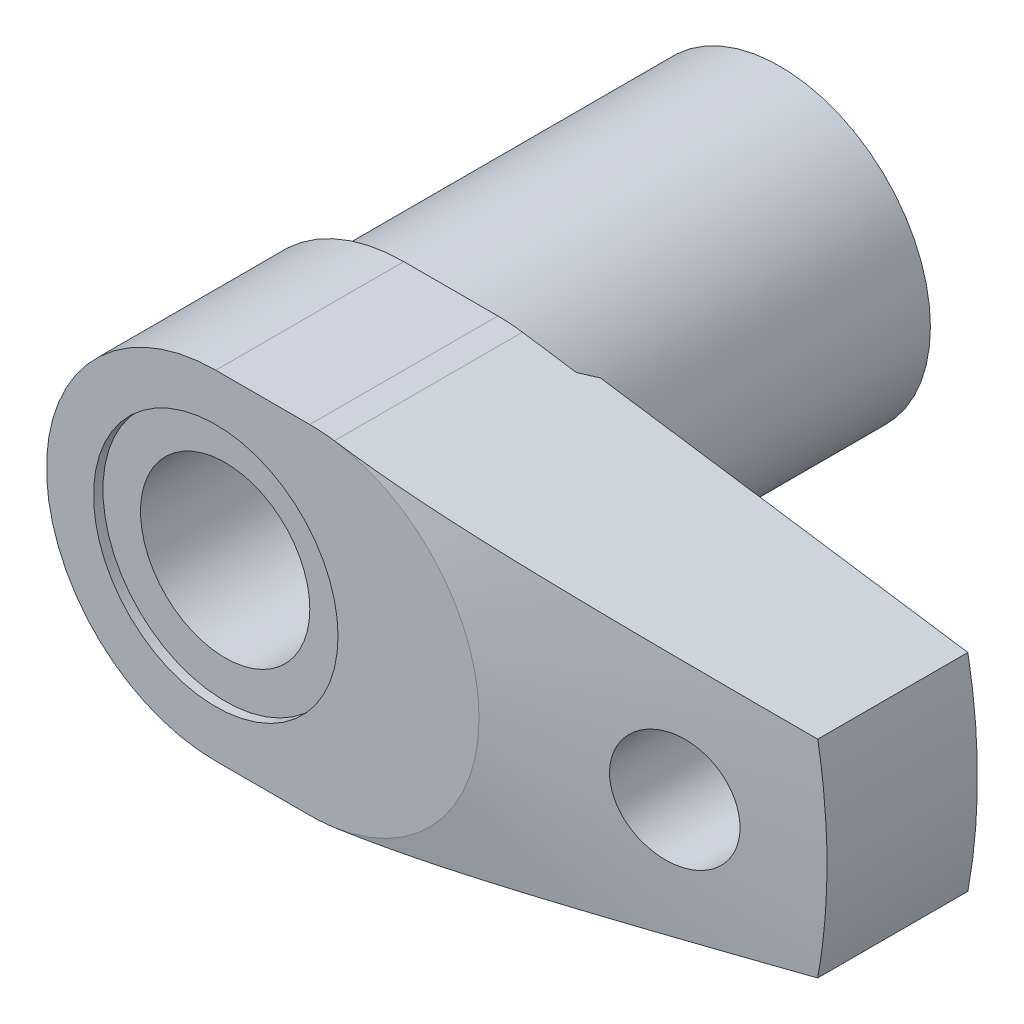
ISO-10303-21;
HEADER;
FILE_DESCRIPTION(('STEP AP214'),'2;1');
FILE_NAME('part.step','',(''),(''),'','','');
FILE_SCHEMA(('AUTOMOTIVE_DESIGN { 1 0 10303 214 1 1 1 1 }'));
ENDSEC;
DATA;
#1=APPLICATION_CONTEXT('core data for automotive mechanical design processes');
#2=APPLICATION_PROTOCOL_DEFINITION('international standard','automotive_design',2000,#1);
#3=PRODUCT_CONTEXT('',#1,'mechanical');
#4=PRODUCT('Part','Part','',(#3));
#5=PRODUCT_RELATED_PRODUCT_CATEGORY('part','',(#4));
#6=PRODUCT_DEFINITION_FORMATION('','',#4);
#7=PRODUCT_DEFINITION_CONTEXT('part definition',#1,'design');
#8=PRODUCT_DEFINITION('design','',#6,#7);
#9=PRODUCT_DEFINITION_SHAPE('','',#8);
#10=(LENGTH_UNIT() NAMED_UNIT(*) SI_UNIT(.MILLI.,.METRE.));
#11=(NAMED_UNIT(*) PLANE_ANGLE_UNIT() SI_UNIT($,.RADIAN.));
#12=(NAMED_UNIT(*) SI_UNIT($,.STERADIAN.) SOLID_ANGLE_UNIT());
#13=UNCERTAINTY_MEASURE_WITH_UNIT(LENGTH_MEASURE(1.E-05),#10,'distance_accuracy_value','');
#14=(GEOMETRIC_REPRESENTATION_CONTEXT(3) GLOBAL_UNCERTAINTY_ASSIGNED_CONTEXT((#13)) GLOBAL_UNIT_ASSIGNED_CONTEXT((#10,
#11,#12)) REPRESENTATION_CONTEXT('',''));
#15=CARTESIAN_POINT('',(0.,0.,0.));
#16=DIRECTION('',(0.,0.,1.));
#17=DIRECTION('',(1.,0.,0.));
#18=AXIS2_PLACEMENT_3D('',#15,#16,#17);
#19=CARTESIAN_POINT('',(-16.,0.,40.));
#20=DIRECTION('',(0.,0.,-1.));
#21=DIRECTION('',(-1.,0.,0.));
#22=AXIS2_PLACEMENT_3D('',#19,#20,#21);
#23=PLANE('',#22);
#24=CARTESIAN_POINT('',(0.,0.,40.));
#25=DIRECTION('',(0.,0.,1.));
#26=DIRECTION('',(1.,0.,0.));
#27=AXIS2_PLACEMENT_3D('',#24,#25,#26);
#28=CIRCLE('',#27,16.);
#29=CARTESIAN_POINT('',(16.,0.,40.));
#30=VERTEX_POINT('',#29);
#31=EDGE_CURVE('E216',#30,#30,#28,.T.);
#32=ORIENTED_EDGE('',*,*,#31,.T.);
#33=EDGE_LOOP('',(#32));
#34=FACE_BOUND('',#33,.T.);
#35=DIRECTION('',(0.989389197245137,-0.145289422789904,0.));
#36=VECTOR('',#35,1.);
#37=CARTESIAN_POINT('',(12.6152096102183,17.8090055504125,40.));
#38=LINE('',#37,#36);
#39=CARTESIAN_POINT('',(12.6152096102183,17.8090055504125,40.));
#40=VERTEX_POINT('',#39);
#41=CARTESIAN_POINT('',(18.362700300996,16.9650003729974,40.));
#42=VERTEX_POINT('',#41);
#43=EDGE_CURVE('E238',#40,#42,#38,.T.);
#44=ORIENTED_EDGE('',*,*,#43,.T.);
#45=CARTESIAN_POINT('',(0.,0.,40.));
#46=DIRECTION('',(0.,0.,1.));
#47=DIRECTION('',(-1.,0.,0.));
#48=AXIS2_PLACEMENT_3D('',#45,#46,#47);
#49=CIRCLE('',#48,25.);
#50=CARTESIAN_POINT('',(18.362700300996,-16.9650003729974,40.));
#51=VERTEX_POINT('',#50);
#52=EDGE_CURVE('E181',#51,#42,#49,.T.);
#53=ORIENTED_EDGE('',*,*,#52,.F.);
#54=DIRECTION('',(-0.989389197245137,-0.145289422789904,0.));
#55=VECTOR('',#54,1.);
#56=CARTESIAN_POINT('',(31.613698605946,-15.0191231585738,40.));
#57=LINE('',#56,#55);
#58=CARTESIAN_POINT('',(12.6152096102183,-17.8090055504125,40.));
#59=VERTEX_POINT('',#58);
#60=EDGE_CURVE('E236',#51,#59,#57,.T.);
#61=ORIENTED_EDGE('',*,*,#60,.T.);
#62=CARTESIAN_POINT('',(10.,0.,40.));
#63=DIRECTION('',(0.,0.,-1.));
#64=DIRECTION('',(-1.,0.,0.));
#65=AXIS2_PLACEMENT_3D('',#62,#63,#64);
#66=CIRCLE('',#65,18.);
#67=CARTESIAN_POINT('',(10.,-18.,40.));
#68=VERTEX_POINT('',#67);
#69=EDGE_CURVE('E233',#59,#68,#66,.T.);
#70=ORIENTED_EDGE('',*,*,#69,.T.);
#71=DIRECTION('',(-1.,0.,0.));
#72=VECTOR('',#71,1.);
#73=CARTESIAN_POINT('',(10.,-18.,40.));
#74=LINE('',#73,#72);
#75=CARTESIAN_POINT('',(0.,-18.,40.));
#76=VERTEX_POINT('',#75);
#77=EDGE_CURVE('E73',#68,#76,#74,.T.);
#78=ORIENTED_EDGE('',*,*,#77,.T.);
#79=CARTESIAN_POINT('',(0.,0.,40.));
#80=DIRECTION('',(0.,0.,1.));
#81=DIRECTION('',(1.,0.,0.));
#82=AXIS2_PLACEMENT_3D('',#79,#80,#81);
#83=CIRCLE('',#82,18.);
#84=CARTESIAN_POINT('',(0.,18.,40.));
#85=VERTEX_POINT('',#84);
#86=EDGE_CURVE('E220',#85,#76,#83,.T.);
#87=ORIENTED_EDGE('',*,*,#86,.F.);
#88=DIRECTION('',(1.,0.,0.));
#89=VECTOR('',#88,1.);
#90=CARTESIAN_POINT('',(0.,18.,40.));
#91=LINE('',#90,#89);
#92=CARTESIAN_POINT('',(10.,18.,40.));
#93=VERTEX_POINT('',#92);
#94=EDGE_CURVE('E224',#85,#93,#91,.T.);
#95=ORIENTED_EDGE('',*,*,#94,.T.);
#96=CARTESIAN_POINT('',(10.,0.,40.));
#97=DIRECTION('',(0.,0.,-1.));
#98=DIRECTION('',(-1.,0.,0.));
#99=AXIS2_PLACEMENT_3D('',#96,#97,#98);
#100=CIRCLE('',#99,18.);
#101=EDGE_CURVE('E163',#93,#40,#100,.T.);
#102=ORIENTED_EDGE('',*,*,#101,.T.);
#103=EDGE_LOOP('',(#44,#53,#61,#70,#78,#87,#95,#102));
#104=FACE_BOUND('',#103,.T.);
#105=ADVANCED_FACE('F14',(#34,#104),#23,.T.);
#106=CARTESIAN_POINT('',(58.9830484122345,-11.,39.));
#107=DIRECTION('',(0.145289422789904,-0.989389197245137,0.));
#108=DIRECTION('',(0.989389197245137,0.145289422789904,0.));
#109=AXIS2_PLACEMENT_3D('',#106,#107,#108);
#110=PLANE('',#109);
#111=CARTESIAN_POINT('',(32.7121770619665,-14.8578142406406,29.071721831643));
#112=CARTESIAN_POINT('',(32.1768504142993,-14.9364256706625,29.5265828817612));
#113=CARTESIAN_POINT('',(31.6398060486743,-15.015289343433,29.9793922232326));
#114=CARTESIAN_POINT('',(30.561720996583,-15.173603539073,30.8801766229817));
#115=CARTESIAN_POINT('',(30.0206801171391,-15.2530540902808,31.3281514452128));
#116=CARTESIAN_POINT('',(28.9334121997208,-15.4127167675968,32.2190494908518));
#117=CARTESIAN_POINT('',(28.387179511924,-15.4929297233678,32.6619656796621));
#118=CARTESIAN_POINT('',(27.2895463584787,-15.6541145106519,33.5411992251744));
#119=CARTESIAN_POINT('',(26.7381459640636,-15.7350863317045,33.9775166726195));
#120=CARTESIAN_POINT('',(25.6094576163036,-15.9008314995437,34.8579288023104));
#121=CARTESIAN_POINT('',(25.0319518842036,-15.9856368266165,35.3017387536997));
#122=CARTESIAN_POINT('',(23.8695212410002,-16.1563369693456,36.1793706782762));
#123=CARTESIAN_POINT('',(23.2845961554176,-16.2422318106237,36.6131924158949));
#124=CARTESIAN_POINT('',(22.1063977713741,-16.4152474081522,37.4685343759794));
#125=CARTESIAN_POINT('',(21.513128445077,-16.5023675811,37.8900601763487));
#126=CARTESIAN_POINT('',(20.316567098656,-16.6780797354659,38.7183158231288));
#127=CARTESIAN_POINT('',(19.7132756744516,-16.7666716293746,39.1250465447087));
#128=CARTESIAN_POINT('',(18.7393341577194,-16.9096925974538,39.7607195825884));
#129=CARTESIAN_POINT('',(18.3724338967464,-16.963571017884,39.995535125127));
#130=CARTESIAN_POINT('',(17.634037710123,-17.0720027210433,40.4576559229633));
#131=CARTESIAN_POINT('',(17.2625419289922,-17.1265559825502,40.6849614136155));
#132=CARTESIAN_POINT('',(16.5144396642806,-17.2364129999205,41.1310358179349));
#133=CARTESIAN_POINT('',(16.1378320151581,-17.291716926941,41.3498027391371));
#134=CARTESIAN_POINT('',(15.3791617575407,-17.4031258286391,41.7774652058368));
#135=CARTESIAN_POINT('',(14.9970991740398,-17.4592307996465,41.986360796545));
#136=CARTESIAN_POINT('',(14.2324631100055,-17.5715157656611,42.3899557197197));
#137=CARTESIAN_POINT('',(13.849971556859,-17.6276837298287,42.5848127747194));
#138=CARTESIAN_POINT('',(13.0789223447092,-17.7409104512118,42.9618096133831));
#139=CARTESIAN_POINT('',(12.6903645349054,-17.7979692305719,43.1439490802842));
#140=CARTESIAN_POINT('',(11.5152496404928,-17.9705320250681,43.6684241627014));
#141=CARTESIAN_POINT('',(10.7188641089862,-18.0874793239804,43.9890248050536));
#142=CARTESIAN_POINT('',(9.33451213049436,-18.2907680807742,44.4722574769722));
#143=CARTESIAN_POINT('',(8.75298355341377,-18.376164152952,44.6537485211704));
#144=CARTESIAN_POINT('',(7.57797857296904,-18.5487108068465,44.9711760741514));
#145=CARTESIAN_POINT('',(6.98450990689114,-18.6358602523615,45.1071411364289));
#146=CARTESIAN_POINT('',(6.08187618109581,-18.7684098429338,45.2731006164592));
#147=CARTESIAN_POINT('',(5.77609718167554,-18.8133127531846,45.3223567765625));
#148=CARTESIAN_POINT('',(5.16261946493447,-18.9034004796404,45.4067127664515));
#149=CARTESIAN_POINT('',(4.8549208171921,-18.948585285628,45.4418131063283));
#150=CARTESIAN_POINT('',(4.23750343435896,-19.0392515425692,45.497363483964));
#151=CARTESIAN_POINT('',(3.92778165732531,-19.0847334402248,45.5177790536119));
#152=CARTESIAN_POINT('',(3.30766991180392,-19.1757953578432,45.5435534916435));
#153=CARTESIAN_POINT('',(2.99727983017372,-19.2213753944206,45.5489095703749));
#154=CARTESIAN_POINT('',(2.68693144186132,-19.2669493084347,45.5465957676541));
#155=B_SPLINE_CURVE_WITH_KNOTS('',3,(#111,#112,#113,#114,#115,#116,#117,#118,#119,#120,#121,
#122,#123,#124,#125,#126,#127,#128,#129,#130,#131,#132,#133,#134,#135,#136,#137,#138,#139,#140,
#141,#142,#143,#144,#145,#146,#147,#148,#149,#150,#151,#152,#153,#154),.UNSPECIFIED.,.F.,.F.,(4,
2,2,2,2,2,2,2,2,2,2,2,2,2,2,2,2,2,2,2,2,4),(0.,2.12059178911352,4.24128665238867,
6.36463930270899,8.48796272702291,10.687657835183,12.8874047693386,15.0861377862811,
17.284740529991,18.6014485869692,19.9181153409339,21.235087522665,22.5520536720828,
23.8505951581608,25.1491689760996,27.7449897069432,29.5890130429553,31.4318776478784,
32.3704819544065,33.309052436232,34.2498188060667,35.1907594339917),.UNSPECIFIED.);
#156=CARTESIAN_POINT('',(19.8939059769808,-16.7401465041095,39.));
#157=VERTEX_POINT('',#156);
#158=EDGE_CURVE('E173',#157,#51,#155,.T.);
#159=ORIENTED_EDGE('',*,*,#158,.F.);
#160=DIRECTION('',(0.989389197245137,0.145289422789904,0.));
#161=VECTOR('',#160,1.);
#162=CARTESIAN_POINT('',(58.9830484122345,-11.,39.));
#163=LINE('',#162,#161);
#164=CARTESIAN_POINT('',(58.9830484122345,-11.,39.));
#165=VERTEX_POINT('',#164);
#166=EDGE_CURVE('E43',#157,#165,#163,.T.);
#167=ORIENTED_EDGE('',*,*,#166,.T.);
#168=DIRECTION('',(0.,0.,-1.));
#169=VECTOR('',#168,1.);
#170=CARTESIAN_POINT('',(58.9830484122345,-11.,60.));
#171=LINE('',#170,#169);
#172=CARTESIAN_POINT('',(58.9830484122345,-11.,54.9682846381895));
#173=VERTEX_POINT('',#172);
#174=EDGE_CURVE('E125',#173,#165,#171,.T.);
#175=ORIENTED_EDGE('',*,*,#174,.F.);
#176=CARTESIAN_POINT('',(58.9832484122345,-10.9999706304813,54.9682551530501));
#177=CARTESIAN_POINT('',(58.0214058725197,-11.1412148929,55.1100465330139));
#178=CARTESIAN_POINT('',(57.0594852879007,-11.2824706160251,55.251299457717));
#179=CARTESIAN_POINT('',(55.1354545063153,-11.5650099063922,55.5324883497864));
#180=CARTESIAN_POINT('',(54.1733443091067,-11.7062934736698,55.6724243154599));
#181=CARTESIAN_POINT('',(52.2489840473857,-11.988881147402,55.9507271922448));
#182=CARTESIAN_POINT('',(51.2867340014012,-12.1301852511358,56.0890942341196));
#183=CARTESIAN_POINT('',(49.3619717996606,-12.4128319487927,56.3639534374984));
#184=CARTESIAN_POINT('',(48.3994596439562,-12.5541745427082,56.5004455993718));
#185=CARTESIAN_POINT('',(46.4750142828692,-12.8367747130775,56.771030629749));
#186=CARTESIAN_POINT('',(45.5130813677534,-12.9780322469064,56.9051256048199));
#187=CARTESIAN_POINT('',(43.5888402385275,-13.2606024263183,57.1705348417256));
#188=CARTESIAN_POINT('',(42.6265320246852,-13.4019150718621,57.3018491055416));
#189=CARTESIAN_POINT('',(40.7013579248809,-13.6846222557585,57.5610504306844));
#190=CARTESIAN_POINT('',(39.7384919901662,-13.8260168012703,57.6889371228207));
#191=CARTESIAN_POINT('',(37.81220765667,-14.1088870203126,57.94040722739));
#192=CARTESIAN_POINT('',(36.8487892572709,-14.2503626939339,58.0639906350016));
#193=CARTESIAN_POINT('',(34.9199051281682,-14.5336146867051,58.3058969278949));
#194=CARTESIAN_POINT('',(33.9544384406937,-14.6753911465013,58.4242120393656));
#195=CARTESIAN_POINT('',(32.0226951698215,-14.9590629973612,58.6539019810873));
#196=CARTESIAN_POINT('',(31.0564185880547,-15.1009583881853,58.7652768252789));
#197=CARTESIAN_POINT('',(29.1231390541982,-15.3848558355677,58.979111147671));
#198=CARTESIAN_POINT('',(28.156136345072,-15.5268578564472,59.0815728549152));
#199=CARTESIAN_POINT('',(26.2209912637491,-15.8110292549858,59.275114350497));
#200=CARTESIAN_POINT('',(25.2528488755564,-15.9531986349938,59.36619397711));
#201=CARTESIAN_POINT('',(23.3142894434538,-16.2378714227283,59.5339788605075));
#202=CARTESIAN_POINT('',(22.3438710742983,-16.3803750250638,59.6106686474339));
#203=CARTESIAN_POINT('',(20.4018241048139,-16.6655599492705,59.7459979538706));
#204=CARTESIAN_POINT('',(19.4301955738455,-16.8082412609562,59.8046384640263));
#205=CARTESIAN_POINT('',(17.9715594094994,-17.0224384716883,59.8764524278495));
#206=CARTESIAN_POINT('',(17.484935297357,-17.0938980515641,59.8977050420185));
#207=CARTESIAN_POINT('',(16.5114734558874,-17.2368485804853,59.9344442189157));
#208=CARTESIAN_POINT('',(16.0246357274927,-17.3083395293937,59.9499308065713));
#209=CARTESIAN_POINT('',(15.0507109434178,-17.4513580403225,59.9748347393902));
#210=CARTESIAN_POINT('',(14.5636238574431,-17.5228856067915,59.9842508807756));
#211=CARTESIAN_POINT('',(13.5893617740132,-17.6659536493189,59.9968451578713));
#212=CARTESIAN_POINT('',(13.1021867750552,-17.737494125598,60.0000231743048));
#213=CARTESIAN_POINT('',(12.6150096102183,-17.8090349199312,59.9999999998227));
#214=B_SPLINE_CURVE_WITH_KNOTS('',3,(#176,#177,#178,#179,#180,#181,#182,#183,#184,#185,#186,
#187,#188,#189,#190,#191,#192,#193,#194,#195,#196,#197,#198,#199,#200,#201,#202,#203,#204,#205,
#206,#207,#208,#209,#210,#211,#212,#213),.UNSPECIFIED.,.F.,.F.,(4,2,2,2,2,2,2,2,2,2,2,2,2,2,2,2,
2,2,4),(0.,2.94733174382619,5.89466727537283,8.84175532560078,11.7888427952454,14.7331987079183,
17.6775525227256,20.6222222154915,23.5668952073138,26.5157783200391,29.4646555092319,
32.4127930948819,35.360972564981,38.3123035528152,41.2634725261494,42.7403498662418,
44.2172208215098,45.6943845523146,47.1715765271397),.UNSPECIFIED.);
#215=CARTESIAN_POINT('',(12.6152096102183,-17.8090055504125,60.));
#216=VERTEX_POINT('',#215);
#217=EDGE_CURVE('E34',#173,#216,#214,.T.);
#218=ORIENTED_EDGE('',*,*,#217,.T.);
#219=DIRECTION('',(0.,0.,1.));
#220=VECTOR('',#219,1.);
#221=CARTESIAN_POINT('',(12.6152096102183,-17.8090055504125,39.));
#222=LINE('',#221,#220);
#223=EDGE_CURVE('E76',#59,#216,#222,.T.);
#224=ORIENTED_EDGE('',*,*,#223,.F.);
#225=ORIENTED_EDGE('',*,*,#60,.F.);
#226=EDGE_LOOP('',(#159,#167,#175,#218,#224,#225));
#227=FACE_BOUND('',#226,.T.);
#228=ADVANCED_FACE('F165',(#227),#110,.T.);
#229=CARTESIAN_POINT('',(58.9830484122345,11.,39.));
#230=DIRECTION('',(0.145289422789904,0.989389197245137,0.));
#231=DIRECTION('',(-0.989389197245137,0.145289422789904,0.));
#232=AXIS2_PLACEMENT_3D('',#229,#230,#231);
#233=PLANE('',#232);
#234=CARTESIAN_POINT('',(2.68693144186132,19.2669493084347,45.5465957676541));
#235=CARTESIAN_POINT('',(2.98145158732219,19.223699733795,45.5487858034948));
#236=CARTESIAN_POINT('',(3.27601082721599,19.1804444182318,45.5440756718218));
#237=CARTESIAN_POINT('',(3.86456646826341,19.0940164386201,45.5210787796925));
#238=CARTESIAN_POINT('',(4.15856294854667,19.0508437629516,45.5027940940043));
#239=CARTESIAN_POINT('',(4.74486318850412,18.9647469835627,45.452921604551));
#240=CARTESIAN_POINT('',(5.03716914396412,18.9218225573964,45.4213601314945));
#241=CARTESIAN_POINT('',(5.62013073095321,18.8362160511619,45.3453947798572));
#242=CARTESIAN_POINT('',(5.91078631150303,18.7935339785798,45.3009905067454));
#243=CARTESIAN_POINT('',(6.76882599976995,18.6675329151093,45.1512224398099));
#244=CARTESIAN_POINT('',(7.33328394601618,18.5846436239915,45.0283225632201));
#245=CARTESIAN_POINT('',(8.451700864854,18.4204067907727,44.7406011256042));
#246=CARTESIAN_POINT('',(9.00565480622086,18.339059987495,44.5757599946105));
#247=CARTESIAN_POINT('',(10.1423179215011,18.1721437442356,44.1966843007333));
#248=CARTESIAN_POINT('',(10.7241221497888,18.0867071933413,43.979697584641));
#249=CARTESIAN_POINT('',(11.874146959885,17.9178288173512,43.5113812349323));
#250=CARTESIAN_POINT('',(12.4423622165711,17.8343877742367,43.260038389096));
#251=CARTESIAN_POINT('',(13.5665418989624,17.6693046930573,42.7288803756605));
#252=CARTESIAN_POINT('',(14.1224869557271,17.5876654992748,42.4490236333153));
#253=CARTESIAN_POINT('',(15.2223159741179,17.4261582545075,41.8663475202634));
#254=CARTESIAN_POINT('',(15.7662012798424,17.3462900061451,41.5635307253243));
#255=CARTESIAN_POINT('',(16.8534042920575,17.186636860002,40.9331890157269));
#256=CARTESIAN_POINT('',(17.3965176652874,17.106881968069,40.6053057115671));
#257=CARTESIAN_POINT('',(18.4729358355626,16.9488125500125,39.9335173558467));
#258=CARTESIAN_POINT('',(19.0062403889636,16.8704980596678,39.5896119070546));
#259=CARTESIAN_POINT('',(20.0638152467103,16.7151957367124,38.888857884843));
#260=CARTESIAN_POINT('',(20.5880925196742,16.638206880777,38.5320200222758));
#261=CARTESIAN_POINT('',(21.6291298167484,16.485333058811,37.8073541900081));
#262=CARTESIAN_POINT('',(22.1458899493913,16.4094480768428,37.4395263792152));
#263=CARTESIAN_POINT('',(23.0989749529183,16.2694898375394,36.7482164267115));
#264=CARTESIAN_POINT('',(23.5361770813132,16.2052877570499,36.4259666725));
#265=CARTESIAN_POINT('',(24.4062909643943,16.0775136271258,35.7755947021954));
#266=CARTESIAN_POINT('',(24.8392026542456,16.013941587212,35.4474723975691));
#267=CARTESIAN_POINT('',(25.7012470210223,15.8873524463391,34.7860686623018));
#268=CARTESIAN_POINT('',(26.130379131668,15.8243354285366,34.4527864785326));
#269=CARTESIAN_POINT('',(26.9852017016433,15.6988067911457,33.7817424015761));
#270=CARTESIAN_POINT('',(27.4108921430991,15.6362951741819,33.4439804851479));
#271=CARTESIAN_POINT('',(28.2466579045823,15.5135649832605,32.7745441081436));
#272=CARTESIAN_POINT('',(28.6568232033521,15.4533331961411,32.442984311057));
#273=CARTESIAN_POINT('',(29.4745229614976,15.3332559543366,31.7765666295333));
#274=CARTESIAN_POINT('',(29.8820574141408,15.2734105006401,31.4417087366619));
#275=CARTESIAN_POINT('',(30.6946035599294,15.1540900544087,30.7691723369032));
#276=CARTESIAN_POINT('',(31.099616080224,15.094614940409,30.43149485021));
#277=CARTESIAN_POINT('',(31.9074698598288,14.9759835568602,29.7535083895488));
#278=CARTESIAN_POINT('',(32.3103111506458,14.9168272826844,29.4131994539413));
#279=CARTESIAN_POINT('',(32.7121770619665,14.8578142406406,29.071721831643));
#280=B_SPLINE_CURVE_WITH_KNOTS('',3,(#234,#235,#236,#237,#238,#239,#240,#241,#242,#243,#244,
#245,#246,#247,#248,#249,#250,#251,#252,#253,#254,#255,#256,#257,#258,#259,#260,#261,#262,#263,
#264,#265,#266,#267,#268,#269,#270,#271,#272,#273,#274,#275,#276,#277,#278,#279),.UNSPECIFIED.,
.F.,.F.,(4,2,2,2,2,2,2,2,2,2,2,2,2,2,2,2,2,2,2,2,2,2,4),(0.,0.89296364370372,1.78579083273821,
2.67685564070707,3.5679478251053,5.31675475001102,7.06637917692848,8.94545546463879,
10.8252564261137,12.7078385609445,14.590209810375,16.5080976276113,18.4260330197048,
20.3424147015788,22.2587686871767,23.899451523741,25.5401591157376,27.1811084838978,
28.82206636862,30.4145797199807,32.0070971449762,33.5990613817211,35.1910024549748),.UNSPECIFIED.);
#281=CARTESIAN_POINT('',(19.8939059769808,16.7401465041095,39.));
#282=VERTEX_POINT('',#281);
#283=EDGE_CURVE('E182',#42,#282,#280,.T.);
#284=ORIENTED_EDGE('',*,*,#283,.F.);
#285=ORIENTED_EDGE('',*,*,#43,.F.);
#286=DIRECTION('',(0.,0.,1.));
#287=VECTOR('',#286,1.);
#288=CARTESIAN_POINT('',(12.6152096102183,17.8090055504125,39.));
#289=LINE('',#288,#287);
#290=CARTESIAN_POINT('',(12.6152096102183,17.8090055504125,60.));
#291=VERTEX_POINT('',#290);
#292=EDGE_CURVE('E106',#40,#291,#289,.T.);
#293=ORIENTED_EDGE('',*,*,#292,.T.);
#294=CARTESIAN_POINT('',(12.6150096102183,17.8090349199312,59.9999999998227));
#295=CARTESIAN_POINT('',(12.9896160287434,17.7540248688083,60.0000068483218));
#296=CARTESIAN_POINT('',(13.3642199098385,17.6990151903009,59.9981340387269));
#297=CARTESIAN_POINT('',(14.1133889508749,17.5890015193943,59.9906818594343));
#298=CARTESIAN_POINT('',(14.4879541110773,17.5339975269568,59.985102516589));
#299=CARTESIAN_POINT('',(15.6114717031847,17.3690116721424,59.9628853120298));
#300=CARTESIAN_POINT('',(16.3603237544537,17.2590445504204,59.9407682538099));
#301=CARTESIAN_POINT('',(17.8570506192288,17.0392538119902,59.8829425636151));
#302=CARTESIAN_POINT('',(18.6049257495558,16.9294301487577,59.8472421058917));
#303=CARTESIAN_POINT('',(20.1000237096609,16.7098786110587,59.7636991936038));
#304=CARTESIAN_POINT('',(20.8472465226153,16.6001507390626,59.7158564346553));
#305=CARTESIAN_POINT('',(22.340269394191,16.3809039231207,59.6097084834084));
#306=CARTESIAN_POINT('',(23.0860701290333,16.2713848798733,59.5514129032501));
#307=CARTESIAN_POINT('',(24.5769445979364,16.052453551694,59.4259383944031));
#308=CARTESIAN_POINT('',(25.322018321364,15.9430412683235,59.3587593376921));
#309=CARTESIAN_POINT('',(26.8115041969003,15.7243138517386,59.2169848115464));
#310=CARTESIAN_POINT('',(27.5559163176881,15.6149987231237,59.142389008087));
#311=CARTESIAN_POINT('',(29.0441142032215,15.3964604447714,58.987051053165));
#312=CARTESIAN_POINT('',(29.787899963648,15.2872372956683,58.9063088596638));
#313=CARTESIAN_POINT('',(31.7194176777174,15.0035985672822,58.6899793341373));
#314=CARTESIAN_POINT('',(32.9067179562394,14.8292463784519,58.5504618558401));
#315=CARTESIAN_POINT('',(35.2801844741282,14.4807085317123,58.2619120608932));
#316=CARTESIAN_POINT('',(36.4663507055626,14.3065228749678,58.1128796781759));
#317=CARTESIAN_POINT('',(38.244899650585,14.0453472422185,57.8839917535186));
#318=CARTESIAN_POINT('',(38.8376208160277,13.9583075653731,57.8068074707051));
#319=CARTESIAN_POINT('',(40.0228601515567,13.7842580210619,57.6508834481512));
#320=CARTESIAN_POINT('',(40.6153783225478,13.6972481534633,57.572143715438));
#321=CARTESIAN_POINT('',(42.3926784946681,13.4362559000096,57.3339000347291));
#322=CARTESIAN_POINT('',(43.5771950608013,13.262312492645,57.1723730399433));
#323=CARTESIAN_POINT('',(45.9474791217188,12.9142419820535,56.8449320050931));
#324=CARTESIAN_POINT('',(47.1332457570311,12.740115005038,56.6790116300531));
#325=CARTESIAN_POINT('',(49.5043268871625,12.3919274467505,56.3439273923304));
#326=CARTESIAN_POINT('',(50.6896413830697,12.2178668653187,56.1747635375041));
#327=CARTESIAN_POINT('',(53.0598393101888,11.8698090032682,55.8338834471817));
#328=CARTESIAN_POINT('',(54.244722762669,11.6958117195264,55.6621673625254));
#329=CARTESIAN_POINT('',(56.6141924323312,11.347860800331,55.3166529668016));
#330=CARTESIAN_POINT('',(57.7987786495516,11.1739071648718,55.1428546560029));
#331=CARTESIAN_POINT('',(58.9832484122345,10.9999706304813,54.9682551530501));
#332=B_SPLINE_CURVE_WITH_KNOTS('',3,(#294,#295,#296,#297,#298,#299,#300,#301,#302,#303,#304,
#305,#306,#307,#308,#309,#310,#311,#312,#313,#314,#315,#316,#317,#318,#319,#320,#321,#322,#323,
#324,#325,#326,#327,#328,#329,#330,#331),.UNSPECIFIED.,.F.,.F.,(4,2,2,2,2,2,2,2,2,2,2,2,2,2,2,2,
2,2,4),(0.,1.13586220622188,2.27171618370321,4.54318916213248,6.81329736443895,9.08346247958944,
11.3515506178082,13.6196714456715,15.887894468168,18.1561330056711,21.7804255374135,
25.4047432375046,27.2168302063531,29.0289089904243,32.6531004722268,36.2828378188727,
39.9125663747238,43.542081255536,47.1715956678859),.UNSPECIFIED.);
#333=CARTESIAN_POINT('',(58.9830484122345,11.,54.9682846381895));
#334=VERTEX_POINT('',#333);
#335=EDGE_CURVE('E150',#291,#334,#332,.T.);
#336=ORIENTED_EDGE('',*,*,#335,.T.);
#337=DIRECTION('',(0.,0.,-1.));
#338=VECTOR('',#337,1.);
#339=CARTESIAN_POINT('',(58.9830484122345,11.,60.));
#340=LINE('',#339,#338);
#341=CARTESIAN_POINT('',(58.9830484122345,11.,39.));
#342=VERTEX_POINT('',#341);
#343=EDGE_CURVE('E28',#334,#342,#340,.T.);
#344=ORIENTED_EDGE('',*,*,#343,.T.);
#345=DIRECTION('',(-0.989389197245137,0.145289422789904,0.));
#346=VECTOR('',#345,1.);
#347=CARTESIAN_POINT('',(58.9830484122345,11.,39.));
#348=LINE('',#347,#346);
#349=EDGE_CURVE('E87',#342,#282,#348,.T.);
#350=ORIENTED_EDGE('',*,*,#349,.T.);
#351=EDGE_LOOP('',(#284,#285,#293,#336,#344,#350));
#352=FACE_BOUND('',#351,.T.);
#353=ADVANCED_FACE('F169',(#352),#233,.T.);
#354=CARTESIAN_POINT('',(0.,0.,60.));
#355=DIRECTION('',(0.,0.,1.));
#356=DIRECTION('',(1.,0.,0.));
#357=AXIS2_PLACEMENT_3D('',#354,#355,#356);
#358=PLANE('',#357);
#359=CARTESIAN_POINT('',(0.,0.,60.));
#360=DIRECTION('',(0.,0.,1.));
#361=DIRECTION('',(1.,0.,0.));
#362=AXIS2_PLACEMENT_3D('',#359,#360,#361);
#363=CIRCLE('',#362,13.);
#364=CARTESIAN_POINT('',(13.,0.,60.));
#365=VERTEX_POINT('',#364);
#366=EDGE_CURVE('E99',#365,#365,#363,.T.);
#367=ORIENTED_EDGE('',*,*,#366,.F.);
#368=EDGE_LOOP('',(#367));
#369=FACE_BOUND('',#368,.T.);
#370=CARTESIAN_POINT('',(10.,0.,60.));
#371=DIRECTION('',(0.,0.,1.));
#372=DIRECTION('',(1.,0.,0.));
#373=AXIS2_PLACEMENT_3D('',#370,#371,#372);
#374=CIRCLE('',#373,18.);
#375=CARTESIAN_POINT('',(10.,-18.,60.));
#376=VERTEX_POINT('',#375);
#377=EDGE_CURVE('E81',#376,#216,#374,.T.);
#378=ORIENTED_EDGE('',*,*,#377,.T.);
#379=CARTESIAN_POINT('',(10.,0.,60.));
#380=DIRECTION('',(0.,0.,-1.));
#381=DIRECTION('',(-1.,0.,0.));
#382=AXIS2_PLACEMENT_3D('',#379,#380,#381);
#383=CIRCLE('',#382,18.);
#384=EDGE_CURVE('E189',#291,#216,#383,.T.);
#385=ORIENTED_EDGE('',*,*,#384,.F.);
#386=CARTESIAN_POINT('',(10.,0.,60.));
#387=DIRECTION('',(0.,0.,1.));
#388=DIRECTION('',(1.,0.,0.));
#389=AXIS2_PLACEMENT_3D('',#386,#387,#388);
#390=CIRCLE('',#389,18.);
#391=CARTESIAN_POINT('',(10.,18.,60.));
#392=VERTEX_POINT('',#391);
#393=EDGE_CURVE('E95',#291,#392,#390,.T.);
#394=ORIENTED_EDGE('',*,*,#393,.T.);
#395=DIRECTION('',(-1.,0.,0.));
#396=VECTOR('',#395,1.);
#397=CARTESIAN_POINT('',(10.,18.,60.));
#398=LINE('',#397,#396);
#399=CARTESIAN_POINT('',(0.,18.,60.));
#400=VERTEX_POINT('',#399);
#401=EDGE_CURVE('E93',#392,#400,#398,.T.);
#402=ORIENTED_EDGE('',*,*,#401,.T.);
#403=CARTESIAN_POINT('',(0.,0.,60.));
#404=DIRECTION('',(0.,0.,1.));
#405=DIRECTION('',(1.,0.,0.));
#406=AXIS2_PLACEMENT_3D('',#403,#404,#405);
#407=CIRCLE('',#406,18.);
#408=CARTESIAN_POINT('',(1.88540101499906E-13,-18.,60.));
#409=VERTEX_POINT('',#408);
#410=EDGE_CURVE('E92',#400,#409,#407,.T.);
#411=ORIENTED_EDGE('',*,*,#410,.T.);
#412=DIRECTION('',(1.,0.,0.));
#413=VECTOR('',#412,1.);
#414=CARTESIAN_POINT('',(1.88540101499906E-13,-18.,60.));
#415=LINE('',#414,#413);
#416=EDGE_CURVE('E69',#409,#376,#415,.T.);
#417=ORIENTED_EDGE('',*,*,#416,.T.);
#418=EDGE_LOOP('',(#378,#385,#394,#402,#411,#417));
#419=FACE_BOUND('',#418,.T.);
#420=ADVANCED_FACE('F89',(#369,#419),#358,.T.);
#421=CARTESIAN_POINT('',(0.,0.,60.));
#422=DIRECTION('',(0.,0.,-1.));
#423=DIRECTION('',(-1.,0.,0.));
#424=AXIS2_PLACEMENT_3D('',#421,#422,#423);
#425=CYLINDRICAL_SURFACE('',#424,60.);
#426=CARTESIAN_POINT('',(58.9830111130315,-11.0002,54.9682834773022));
#427=CARTESIAN_POINT('',(59.1527597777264,-10.090099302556,54.9735670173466));
#428=CARTESIAN_POINT('',(59.3014127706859,-9.17606069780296,54.9781986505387));
#429=CARTESIAN_POINT('',(59.5562787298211,-7.3420860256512,54.9861448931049));
#430=CARTESIAN_POINT('',(59.6624919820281,-6.42214999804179,54.9894595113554));
#431=CARTESIAN_POINT('',(59.8315167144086,-4.58611708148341,54.9947362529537));
#432=CARTESIAN_POINT('',(59.89468647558,-3.67005319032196,54.9967095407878));
#433=CARTESIAN_POINT('',(59.978928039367,-1.83599286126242,54.9993414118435));
#434=CARTESIAN_POINT('',(60.,-0.91799643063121,55.));
#435=CARTESIAN_POINT('',(60.,0.91799643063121,55.));
#436=CARTESIAN_POINT('',(59.978928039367,1.83599286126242,54.9993414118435));
#437=CARTESIAN_POINT('',(59.89468647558,3.67005319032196,54.9967095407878));
#438=CARTESIAN_POINT('',(59.8315167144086,4.58611708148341,54.9947362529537));
#439=CARTESIAN_POINT('',(59.6624919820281,6.4221499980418,54.9894595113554));
#440=CARTESIAN_POINT('',(59.5562787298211,7.3420860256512,54.9861448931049));
#441=CARTESIAN_POINT('',(59.3014127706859,9.17606069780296,54.9781986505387));
#442=CARTESIAN_POINT('',(59.1527597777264,10.090099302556,54.9735670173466));
#443=CARTESIAN_POINT('',(58.9830111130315,11.0002,54.9682834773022));
#444=B_SPLINE_CURVE_WITH_KNOTS('',3,(#426,#427,#428,#429,#430,#431,#432,#433,#434,#435,#436,
#437,#438,#439,#440,#441,#442,#443),.UNSPECIFIED.,.F.,.F.,(4,2,2,2,2,2,2,2,4),(0.,
2.77718454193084,5.55435036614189,8.30810787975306,11.0618550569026,13.8156022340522,
16.5693597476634,19.3465255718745,22.1237101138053),.UNSPECIFIED.);
#445=EDGE_CURVE('E9',#173,#334,#444,.T.);
#446=ORIENTED_EDGE('',*,*,#445,.F.);
#447=ORIENTED_EDGE('',*,*,#174,.T.);
#448=CARTESIAN_POINT('',(0.,0.,39.));
#449=DIRECTION('',(0.,0.,1.));
#450=DIRECTION('',(1.,0.,0.));
#451=AXIS2_PLACEMENT_3D('',#448,#449,#450);
#452=CIRCLE('',#451,60.);
#453=EDGE_CURVE('E118',#165,#342,#452,.T.);
#454=ORIENTED_EDGE('',*,*,#453,.T.);
#455=ORIENTED_EDGE('',*,*,#343,.F.);
#456=EDGE_LOOP('',(#446,#447,#454,#455));
#457=FACE_BOUND('',#456,.T.);
#458=ADVANCED_FACE('F133',(#457),#425,.T.);
#459=CARTESIAN_POINT('',(10.,0.,39.));
#460=DIRECTION('',(0.,0.,1.));
#461=DIRECTION('',(1.,0.,0.));
#462=AXIS2_PLACEMENT_3D('',#459,#460,#461);
#463=CYLINDRICAL_SURFACE('',#462,18.);
#464=DIRECTION('',(0.,0.,1.));
#465=VECTOR('',#464,1.);
#466=CARTESIAN_POINT('',(10.,-18.,39.));
#467=LINE('',#466,#465);
#468=EDGE_CURVE('E64',#68,#376,#467,.T.);
#469=ORIENTED_EDGE('',*,*,#468,.F.);
#470=ORIENTED_EDGE('',*,*,#69,.F.);
#471=ORIENTED_EDGE('',*,*,#223,.T.);
#472=ORIENTED_EDGE('',*,*,#377,.F.);
#473=EDGE_LOOP('',(#469,#470,#471,#472));
#474=FACE_BOUND('',#473,.T.);
#475=ADVANCED_FACE('F82',(#474),#463,.T.);
#476=CARTESIAN_POINT('',(1.88540101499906E-13,-18.,39.));
#477=DIRECTION('',(0.,-1.,0.));
#478=DIRECTION('',(1.,0.,0.));
#479=AXIS2_PLACEMENT_3D('',#476,#477,#478);
#480=PLANE('',#479);
#481=DIRECTION('',(0.,0.,1.));
#482=VECTOR('',#481,1.);
#483=CARTESIAN_POINT('',(1.88540101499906E-13,-18.,39.));
#484=LINE('',#483,#482);
#485=EDGE_CURVE('E77',#76,#409,#484,.T.);
#486=ORIENTED_EDGE('',*,*,#485,.F.);
#487=ORIENTED_EDGE('',*,*,#77,.F.);
#488=ORIENTED_EDGE('',*,*,#468,.T.);
#489=ORIENTED_EDGE('',*,*,#416,.F.);
#490=EDGE_LOOP('',(#486,#487,#488,#489));
#491=FACE_BOUND('',#490,.T.);
#492=ADVANCED_FACE('F67',(#491),#480,.T.);
#493=CARTESIAN_POINT('',(10.,18.,39.));
#494=DIRECTION('',(0.,1.,0.));
#495=DIRECTION('',(-1.,0.,0.));
#496=AXIS2_PLACEMENT_3D('',#493,#494,#495);
#497=PLANE('',#496);
#498=DIRECTION('',(0.,0.,1.));
#499=VECTOR('',#498,1.);
#500=CARTESIAN_POINT('',(10.,18.,39.));
#501=LINE('',#500,#499);
#502=EDGE_CURVE('E104',#93,#392,#501,.T.);
#503=ORIENTED_EDGE('',*,*,#502,.F.);
#504=ORIENTED_EDGE('',*,*,#94,.F.);
#505=DIRECTION('',(0.,0.,1.));
#506=VECTOR('',#505,1.);
#507=CARTESIAN_POINT('',(0.,18.,39.));
#508=LINE('',#507,#506);
#509=EDGE_CURVE('E102',#85,#400,#508,.T.);
#510=ORIENTED_EDGE('',*,*,#509,.T.);
#511=ORIENTED_EDGE('',*,*,#401,.F.);
#512=EDGE_LOOP('',(#503,#504,#510,#511));
#513=FACE_BOUND('',#512,.T.);
#514=ADVANCED_FACE('F264',(#513),#497,.T.);
#515=CARTESIAN_POINT('',(10.,0.,39.));
#516=DIRECTION('',(0.,0.,1.));
#517=DIRECTION('',(1.,0.,0.));
#518=AXIS2_PLACEMENT_3D('',#515,#516,#517);
#519=CYLINDRICAL_SURFACE('',#518,18.);
#520=ORIENTED_EDGE('',*,*,#292,.F.);
#521=ORIENTED_EDGE('',*,*,#101,.F.);
#522=ORIENTED_EDGE('',*,*,#502,.T.);
#523=ORIENTED_EDGE('',*,*,#393,.F.);
#524=EDGE_LOOP('',(#520,#521,#522,#523));
#525=FACE_BOUND('',#524,.T.);
#526=ADVANCED_FACE('F251',(#525),#519,.T.);
#527=CARTESIAN_POINT('',(0.,0.,60.));
#528=DIRECTION('',(0.,0.,-1.));
#529=DIRECTION('',(-1.,0.,0.));
#530=AXIS2_PLACEMENT_3D('',#527,#528,#529);
#531=CYLINDRICAL_SURFACE('',#530,18.);
#532=ORIENTED_EDGE('',*,*,#86,.T.);
#533=ORIENTED_EDGE('',*,*,#485,.T.);
#534=ORIENTED_EDGE('',*,*,#410,.F.);
#535=ORIENTED_EDGE('',*,*,#509,.F.);
#536=EDGE_LOOP('',(#532,#533,#534,#535));
#537=FACE_BOUND('',#536,.T.);
#538=ADVANCED_FACE('F16',(#537),#531,.T.);
#539=CARTESIAN_POINT('',(70.,20.,39.));
#540=DIRECTION('',(0.,0.,1.));
#541=DIRECTION('',(1.,0.,0.));
#542=AXIS2_PLACEMENT_3D('',#539,#540,#541);
#543=PLANE('',#542);
#544=CARTESIAN_POINT('',(46.,0.,39.));
#545=DIRECTION('',(0.,0.,1.));
#546=DIRECTION('',(1.,0.,0.));
#547=AXIS2_PLACEMENT_3D('',#544,#545,#546);
#548=CIRCLE('',#547,6.);
#549=CARTESIAN_POINT('',(52.,0.,39.));
#550=VERTEX_POINT('',#549);
#551=EDGE_CURVE('E427',#550,#550,#548,.T.);
#552=ORIENTED_EDGE('',*,*,#551,.T.);
#553=EDGE_LOOP('',(#552));
#554=FACE_BOUND('',#553,.T.);
#555=ORIENTED_EDGE('',*,*,#166,.F.);
#556=CARTESIAN_POINT('',(0.,0.,39.));
#557=DIRECTION('',(0.,0.,1.));
#558=DIRECTION('',(1.,0.,0.));
#559=AXIS2_PLACEMENT_3D('',#556,#557,#558);
#560=CIRCLE('',#559,26.);
#561=EDGE_CURVE('E212',#157,#282,#560,.T.);
#562=ORIENTED_EDGE('',*,*,#561,.T.);
#563=ORIENTED_EDGE('',*,*,#349,.F.);
#564=ORIENTED_EDGE('',*,*,#453,.F.);
#565=EDGE_LOOP('',(#555,#562,#563,#564));
#566=FACE_BOUND('',#565,.T.);
#567=ADVANCED_FACE('F207',(#554,#566),#543,.F.);
#568=CARTESIAN_POINT('',(0.,0.,60.));
#569=DIRECTION('',(0.,0.,-1.));
#570=DIRECTION('',(-1.,0.,0.));
#571=AXIS2_PLACEMENT_3D('',#568,#569,#570);
#572=CYLINDRICAL_SURFACE('',#571,9.);
#573=CARTESIAN_POINT('',(0.,0.,0.));
#574=DIRECTION('',(0.,0.,1.));
#575=DIRECTION('',(1.,0.,0.));
#576=AXIS2_PLACEMENT_3D('',#573,#574,#575);
#577=CIRCLE('',#576,9.);
#578=CARTESIAN_POINT('',(9.,0.,0.));
#579=VERTEX_POINT('',#578);
#580=EDGE_CURVE('E121',#579,#579,#577,.T.);
#581=ORIENTED_EDGE('',*,*,#580,.F.);
#582=EDGE_LOOP('',(#581));
#583=FACE_BOUND('',#582,.T.);
#584=CARTESIAN_POINT('',(0.,0.,59.));
#585=DIRECTION('',(0.,0.,1.));
#586=DIRECTION('',(1.,0.,0.));
#587=AXIS2_PLACEMENT_3D('',#584,#585,#586);
#588=CIRCLE('',#587,9.);
#589=CARTESIAN_POINT('',(9.,0.,59.));
#590=VERTEX_POINT('',#589);
#591=EDGE_CURVE('E112',#590,#590,#588,.T.);
#592=ORIENTED_EDGE('',*,*,#591,.T.);
#593=EDGE_LOOP('',(#592));
#594=FACE_BOUND('',#593,.T.);
#595=ADVANCED_FACE('F271',(#583,#594),#572,.F.);
#596=CARTESIAN_POINT('',(0.,0.,0.));
#597=DIRECTION('',(0.,0.,1.));
#598=DIRECTION('',(1.,0.,0.));
#599=AXIS2_PLACEMENT_3D('',#596,#597,#598);
#600=PLANE('',#599);
#601=ORIENTED_EDGE('',*,*,#580,.T.);
#602=EDGE_LOOP('',(#601));
#603=FACE_BOUND('',#602,.T.);
#604=CARTESIAN_POINT('',(0.,0.,0.));
#605=DIRECTION('',(0.,0.,-1.));
#606=DIRECTION('',(-1.,0.,0.));
#607=AXIS2_PLACEMENT_3D('',#604,#605,#606);
#608=CIRCLE('',#607,16.);
#609=CARTESIAN_POINT('',(-16.,0.,0.));
#610=VERTEX_POINT('',#609);
#611=EDGE_CURVE('E115',#610,#610,#608,.T.);
#612=ORIENTED_EDGE('',*,*,#611,.T.);
#613=EDGE_LOOP('',(#612));
#614=FACE_BOUND('',#613,.T.);
#615=ADVANCED_FACE('F351',(#603,#614),#600,.F.);
#616=CARTESIAN_POINT('',(0.,0.,39.));
#617=DIRECTION('',(0.,0.,-1.));
#618=DIRECTION('',(-1.,0.,0.));
#619=AXIS2_PLACEMENT_3D('',#616,#617,#618);
#620=CYLINDRICAL_SURFACE('',#619,16.);
#621=ORIENTED_EDGE('',*,*,#611,.F.);
#622=EDGE_LOOP('',(#621));
#623=FACE_BOUND('',#622,.T.);
#624=ORIENTED_EDGE('',*,*,#31,.F.);
#625=EDGE_LOOP('',(#624));
#626=FACE_BOUND('',#625,.T.);
#627=ADVANCED_FACE('F362',(#623,#626),#620,.T.);
#628=CARTESIAN_POINT('',(0.,0.,59.));
#629=DIRECTION('',(0.,0.,1.));
#630=DIRECTION('',(1.,0.,0.));
#631=AXIS2_PLACEMENT_3D('',#628,#629,#630);
#632=CYLINDRICAL_SURFACE('',#631,13.);
#633=CARTESIAN_POINT('',(0.,0.,59.));
#634=DIRECTION('',(0.,0.,1.));
#635=DIRECTION('',(1.,0.,0.));
#636=AXIS2_PLACEMENT_3D('',#633,#634,#635);
#637=CIRCLE('',#636,13.);
#638=CARTESIAN_POINT('',(13.,0.,59.));
#639=VERTEX_POINT('',#638);
#640=EDGE_CURVE('E109',#639,#639,#637,.T.);
#641=ORIENTED_EDGE('',*,*,#640,.F.);
#642=EDGE_LOOP('',(#641));
#643=FACE_BOUND('',#642,.T.);
#644=ORIENTED_EDGE('',*,*,#366,.T.);
#645=EDGE_LOOP('',(#644));
#646=FACE_BOUND('',#645,.T.);
#647=ADVANCED_FACE('F371',(#643,#646),#632,.F.);
#648=CARTESIAN_POINT('',(0.,0.,59.));
#649=DIRECTION('',(0.,0.,1.));
#650=DIRECTION('',(1.,0.,0.));
#651=AXIS2_PLACEMENT_3D('',#648,#649,#650);
#652=PLANE('',#651);
#653=ORIENTED_EDGE('',*,*,#591,.F.);
#654=EDGE_LOOP('',(#653));
#655=FACE_BOUND('',#654,.T.);
#656=ORIENTED_EDGE('',*,*,#640,.T.);
#657=EDGE_LOOP('',(#656));
#658=FACE_BOUND('',#657,.T.);
#659=ADVANCED_FACE('F142',(#655,#658),#652,.T.);
#660=CARTESIAN_POINT('',(10.,0.,53.8108003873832));
#661=DIRECTION('',(0.,0.,-1.));
#662=DIRECTION('',(-1.,0.,0.));
#663=AXIS2_PLACEMENT_3D('',#660,#661,#662);
#664=CONICAL_SURFACE('',#663,57.6108775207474,1.41579958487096);
#665=CARTESIAN_POINT('',(41.6764022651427,-4.16010848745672,57.8205607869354));
#666=CARTESIAN_POINT('',(41.7944966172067,-4.2828450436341,57.7997684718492));
#667=CARTESIAN_POINT('',(41.9177441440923,-4.40046999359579,57.7781990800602));
#668=CARTESIAN_POINT('',(42.1736928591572,-4.62475196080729,57.7337112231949));
#669=CARTESIAN_POINT('',(42.3063968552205,-4.73140569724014,57.7107923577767));
#670=CARTESIAN_POINT('',(42.5803906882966,-4.933076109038,57.6638058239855));
#671=CARTESIAN_POINT('',(42.7216892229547,-5.02808069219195,57.6397369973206));
#672=CARTESIAN_POINT('',(43.0117822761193,-5.2057172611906,57.5906797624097));
#673=CARTESIAN_POINT('',(43.1605795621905,-5.28834463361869,57.5656910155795));
#674=CARTESIAN_POINT('',(43.4643647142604,-5.44053117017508,57.5150477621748));
#675=CARTESIAN_POINT('',(43.6193445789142,-5.51010660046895,57.4893941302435));
#676=CARTESIAN_POINT('',(43.9346299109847,-5.63587281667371,57.4375889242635));
#677=CARTESIAN_POINT('',(44.0949373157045,-5.6920586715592,57.411437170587));
#678=CARTESIAN_POINT('',(44.4195885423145,-5.79060086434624,57.3588631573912));
#679=CARTESIAN_POINT('',(44.5839296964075,-5.8329660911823,57.3324410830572));
#680=CARTESIAN_POINT('',(44.9156556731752,-5.90364017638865,57.2794937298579));
#681=CARTESIAN_POINT('',(45.08304159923,-5.93194382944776,57.2529684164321));
#682=CARTESIAN_POINT('',(45.4205320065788,-5.97438679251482,57.199867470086));
#683=CARTESIAN_POINT('',(45.5906462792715,-5.98844891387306,57.1732923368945));
#684=CARTESIAN_POINT('',(45.9315602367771,-6.00203537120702,57.1204066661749));
#685=CARTESIAN_POINT('',(46.1023601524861,-6.00155431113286,57.0940962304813));
#686=CARTESIAN_POINT('',(46.4433130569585,-5.98603263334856,57.0419304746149));
#687=CARTESIAN_POINT('',(46.6134662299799,-5.9709965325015,57.0160750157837));
#688=CARTESIAN_POINT('',(46.9520242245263,-5.9264502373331,56.9649650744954));
#689=CARTESIAN_POINT('',(47.1204283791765,-5.89693471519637,56.9397108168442));
#690=CARTESIAN_POINT('',(47.4540571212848,-5.82364651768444,56.8899913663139));
#691=CARTESIAN_POINT('',(47.6192845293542,-5.77988717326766,56.8655254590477));
#692=CARTESIAN_POINT('',(47.945583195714,-5.67837264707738,56.8174955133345));
#693=CARTESIAN_POINT('',(48.106652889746,-5.62061228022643,56.7939318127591));
#694=CARTESIAN_POINT('',(48.4233466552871,-5.49150291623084,56.7478606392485));
#695=CARTESIAN_POINT('',(48.5789728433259,-5.42015927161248,56.7253527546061));
#696=CARTESIAN_POINT('',(48.8837124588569,-5.26436548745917,56.6815099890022));
#697=CARTESIAN_POINT('',(49.0328234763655,-5.17991054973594,56.6601755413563));
#698=CARTESIAN_POINT('',(49.4665715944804,-4.90899754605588,56.598419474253));
#699=CARTESIAN_POINT('',(49.7401801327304,-4.70394589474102,56.5598745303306));
#700=CARTESIAN_POINT('',(50.2489257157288,-4.25005811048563,56.4887656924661));
#701=CARTESIAN_POINT('',(50.4840647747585,-4.00122427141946,56.4562014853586));
#702=CARTESIAN_POINT('',(50.9069651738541,-3.46928899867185,56.3979933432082));
#703=CARTESIAN_POINT('',(51.0951595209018,-3.18653933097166,56.3722859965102));
#704=CARTESIAN_POINT('',(51.4213750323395,-2.59295035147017,56.3279193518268));
#705=CARTESIAN_POINT('',(51.5593986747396,-2.28211242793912,56.3092597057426));
#706=CARTESIAN_POINT('',(51.7801347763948,-1.64408036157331,56.2794957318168));
#707=CARTESIAN_POINT('',(51.8633182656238,-1.31705215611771,56.2683270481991));
#708=CARTESIAN_POINT('',(51.9737772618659,-0.653523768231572,56.2535086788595));
#709=CARTESIAN_POINT('',(52.0010547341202,-0.317023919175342,56.2498587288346));
#710=CARTESIAN_POINT('',(51.9988882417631,0.354057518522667,56.2501489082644));
#711=CARTESIAN_POINT('',(51.9697342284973,0.688640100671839,56.2540502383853));
#712=CARTESIAN_POINT('',(51.85615495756,1.34810852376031,56.2692889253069));
#713=CARTESIAN_POINT('',(51.7717302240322,1.67299445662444,56.2806262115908));
#714=CARTESIAN_POINT('',(51.5501426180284,2.30383786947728,56.3105108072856));
#715=CARTESIAN_POINT('',(51.4129876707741,2.60979818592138,56.3290570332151));
#716=CARTESIAN_POINT('',(51.0899904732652,3.19429089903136,56.372992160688));
#717=CARTESIAN_POINT('',(50.9041473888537,3.47282282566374,56.3983811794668));
#718=CARTESIAN_POINT('',(50.488191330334,3.99604428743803,56.4556335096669));
#719=CARTESIAN_POINT('',(50.2578692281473,4.24056417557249,56.4875274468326));
#720=CARTESIAN_POINT('',(49.7602201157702,4.68749514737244,56.5570623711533));
#721=CARTESIAN_POINT('',(49.4928916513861,4.889904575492,56.5947035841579));
#722=CARTESIAN_POINT('',(48.9264651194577,5.24872780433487,56.675290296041));
#723=CARTESIAN_POINT('',(48.6271175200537,5.40473818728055,56.7182779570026));
#724=CARTESIAN_POINT('',(48.0070738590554,5.66432998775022,56.8083666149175));
#725=CARTESIAN_POINT('',(47.6863767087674,5.76790872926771,56.8554678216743));
#726=CARTESIAN_POINT('',(47.0294880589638,5.92072202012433,56.9531838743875));
#727=CARTESIAN_POINT('',(46.6931774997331,5.96942610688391,57.0038280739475));
#728=CARTESIAN_POINT('',(46.0174388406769,6.00951476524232,57.1069899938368));
#729=CARTESIAN_POINT('',(45.6780105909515,6.00089656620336,57.1595078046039));
#730=CARTESIAN_POINT('',(45.0030508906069,5.92640016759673,57.2654372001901));
#731=CARTESIAN_POINT('',(44.6675662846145,5.86010243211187,57.3188525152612));
#732=CARTESIAN_POINT('',(44.0125302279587,5.67151674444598,57.424668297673));
#733=CARTESIAN_POINT('',(43.6929791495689,5.54922748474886,57.4770687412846));
#734=CARTESIAN_POINT('',(43.0784992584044,5.25181702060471,57.5792698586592));
#735=CARTESIAN_POINT('',(42.7836063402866,5.07662045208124,57.6290667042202));
#736=CARTESIAN_POINT('',(42.2273470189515,4.67803110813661,57.7242607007));
#737=CARTESIAN_POINT('',(41.9659799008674,4.45463936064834,57.769657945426));
#738=CARTESIAN_POINT('',(41.6060365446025,4.08927898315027,57.8329203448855));
#739=CARTESIAN_POINT('',(41.4916990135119,3.96286647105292,57.8531492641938));
#740=CARTESIAN_POINT('',(41.2740822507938,3.70063171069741,57.8918671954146));
#741=CARTESIAN_POINT('',(41.1707987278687,3.56481314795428,57.9103568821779));
#742=CARTESIAN_POINT('',(40.9760465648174,3.28466437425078,57.9453991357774));
#743=CARTESIAN_POINT('',(40.8845818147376,3.14033138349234,57.9619510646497));
#744=CARTESIAN_POINT('',(40.7142390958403,2.84427165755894,57.9929155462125));
#745=CARTESIAN_POINT('',(40.635356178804,2.69254785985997,58.0073289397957));
#746=CARTESIAN_POINT('',(40.4917562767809,2.3848847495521,58.0336672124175));
#747=CARTESIAN_POINT('',(40.4268595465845,2.2290319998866,58.0456235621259));
#748=CARTESIAN_POINT('',(40.3104078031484,1.91232686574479,58.067143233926));
#749=CARTESIAN_POINT('',(40.2588475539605,1.75147647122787,58.0767074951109));
#750=CARTESIAN_POINT('',(40.1694335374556,1.42583709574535,58.0933308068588));
#751=CARTESIAN_POINT('',(40.1315833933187,1.26104708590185,58.100389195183));
#752=CARTESIAN_POINT('',(40.0699246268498,0.928835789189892,58.1119038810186));
#753=CARTESIAN_POINT('',(40.0461105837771,0.76141554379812,58.1163611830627));
#754=CARTESIAN_POINT('',(40.0129261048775,0.42744974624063,58.1225759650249));
#755=CARTESIAN_POINT('',(40.0033597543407,0.260924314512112,58.1243700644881));
#756=CARTESIAN_POINT('',(39.9981229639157,-0.0722896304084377,58.1253519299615));
#757=CARTESIAN_POINT('',(40.0024472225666,-0.238978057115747,58.12454069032));
#758=CARTESIAN_POINT('',(40.0249525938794,-0.571481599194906,58.1203232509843));
#759=CARTESIAN_POINT('',(40.0431418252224,-0.737296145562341,58.1169155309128));
#760=CARTESIAN_POINT('',(40.0932339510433,-1.06670504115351,58.1075487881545));
#761=CARTESIAN_POINT('',(40.1251318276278,-1.2303001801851,58.1015906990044));
#762=CARTESIAN_POINT('',(40.2022486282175,-1.55357362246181,58.0872251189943));
#763=CARTESIAN_POINT('',(40.2474182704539,-1.71326408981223,58.078826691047));
#764=CARTESIAN_POINT('',(40.3507549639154,-2.02817232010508,58.0596788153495));
#765=CARTESIAN_POINT('',(40.4089173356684,-2.18339167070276,58.0489302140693));
#766=CARTESIAN_POINT('',(40.5377524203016,-2.48821303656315,58.0252184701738));
#767=CARTESIAN_POINT('',(40.6084141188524,-2.63781985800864,58.0122572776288));
#768=CARTESIAN_POINT('',(40.7617280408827,-2.93049427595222,57.9842677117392));
#769=CARTESIAN_POINT('',(40.844377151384,-3.07356355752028,57.9692398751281));
#770=CARTESIAN_POINT('',(41.040536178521,-3.3829319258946,57.9337600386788));
#771=CARTESIAN_POINT('',(41.1568354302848,-3.54741827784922,57.9128420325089));
#772=CARTESIAN_POINT('',(41.4051708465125,-3.86367303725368,57.8684961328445));
#773=CARTESIAN_POINT('',(41.5372069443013,-4.01544149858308,57.8450682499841));
#774=CARTESIAN_POINT('',(41.6764022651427,-4.16010848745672,57.8205607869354));
#775=B_SPLINE_CURVE_WITH_KNOTS('',3,(#665,#666,#667,#668,#669,#670,#671,#672,#673,#674,#675,
#676,#677,#678,#679,#680,#681,#682,#683,#684,#685,#686,#687,#688,#689,#690,#691,#692,#693,#694,
#695,#696,#697,#698,#699,#700,#701,#702,#703,#704,#705,#706,#707,#708,#709,#710,#711,#712,#713,
#714,#715,#716,#717,#718,#719,#720,#721,#722,#723,#724,#725,#726,#727,#728,#729,#730,#731,#732,
#733,#734,#735,#736,#737,#738,#739,#740,#741,#742,#743,#744,#745,#746,#747,#748,#749,#750,#751,
#752,#753,#754,#755,#756,#757,#758,#759,#760,#761,#762,#763,#764,#765,#766,#767,#768,#769,#770,
#771,#772,#773,#774),.UNSPECIFIED.,.T.,.F.,(4,2,2,2,2,2,2,2,2,2,2,2,2,2,2,2,2,2,2,2,2,2,2,2,2,2,
2,2,2,2,2,2,2,2,2,2,2,2,2,2,2,2,2,2,2,2,2,2,2,2,2,2,2,2,4),(0.,0.5145872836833,1.02932800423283,
1.54459859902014,2.06006077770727,2.57487622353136,3.08988097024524,3.60455382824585,
4.11941706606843,4.63705614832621,5.15488729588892,5.67255779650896,6.19041892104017,
6.70779676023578,7.22536649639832,7.74273270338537,8.26028869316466,9.28714792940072,
10.3139533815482,11.3309050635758,12.3478065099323,13.3558557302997,14.3638695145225,
15.3667177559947,16.3695564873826,17.3722445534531,18.374949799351,19.3824896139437,
20.3900690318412,21.4061686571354,22.4223201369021,23.4482124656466,24.4741543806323,
25.507621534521,26.5411128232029,27.5760832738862,28.611031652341,29.1254600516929,
29.6396880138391,30.1540848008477,30.6682787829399,31.1754078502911,31.6823375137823,
32.1894010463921,32.6962686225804,33.1960999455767,33.6957405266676,34.1956738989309,
34.6954244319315,35.1933422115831,35.6910809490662,36.188383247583,36.685556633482,
37.2920923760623,37.8986255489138),.UNSPECIFIED.);
#776=CARTESIAN_POINT('',(41.6764022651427,-4.16010848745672,57.8205607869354));
#777=VERTEX_POINT('',#776);
#778=EDGE_CURVE('E18',#777,#777,#775,.T.);
#779=ORIENTED_EDGE('',*,*,#778,.F.);
#780=EDGE_LOOP('',(#779));
#781=FACE_BOUND('',#780,.T.);
#782=ORIENTED_EDGE('',*,*,#445,.T.);
#783=ORIENTED_EDGE('',*,*,#335,.F.);
#784=ORIENTED_EDGE('',*,*,#384,.T.);
#785=ORIENTED_EDGE('',*,*,#217,.F.);
#786=EDGE_LOOP('',(#782,#783,#784,#785));
#787=FACE_BOUND('',#786,.T.);
#788=ADVANCED_FACE('F136',(#781,#787),#664,.T.);
#789=CARTESIAN_POINT('',(0.,0.,40.));
#790=DIRECTION('',(0.,0.,-1.));
#791=DIRECTION('',(-1.,0.,0.));
#792=AXIS2_PLACEMENT_3D('',#789,#790,#791);
#793=CONICAL_SURFACE('',#792,25.,0.785398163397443);
#794=ORIENTED_EDGE('',*,*,#158,.T.);
#795=ORIENTED_EDGE('',*,*,#52,.T.);
#796=ORIENTED_EDGE('',*,*,#283,.T.);
#797=ORIENTED_EDGE('',*,*,#561,.F.);
#798=EDGE_LOOP('',(#794,#795,#796,#797));
#799=FACE_BOUND('',#798,.T.);
#800=ADVANCED_FACE('F141',(#799),#793,.F.);
#801=CARTESIAN_POINT('',(46.,0.,60.));
#802=DIRECTION('',(0.,0.,-1.));
#803=DIRECTION('',(-1.,0.,0.));
#804=AXIS2_PLACEMENT_3D('',#801,#802,#803);
#805=CYLINDRICAL_SURFACE('',#804,6.);
#806=ORIENTED_EDGE('',*,*,#778,.T.);
#807=EDGE_LOOP('',(#806));
#808=FACE_BOUND('',#807,.T.);
#809=ORIENTED_EDGE('',*,*,#551,.F.);
#810=EDGE_LOOP('',(#809));
#811=FACE_BOUND('',#810,.T.);
#812=ADVANCED_FACE('F405',(#808,#811),#805,.F.);
#813=CLOSED_SHELL('',(#105,#228,#353,#420,#458,#475,#492,#514,#526,#538,#567,#595,#615,#627,
#647,#659,#788,#800,#812));
#814=MANIFOLD_SOLID_BREP('B1',#813);
#815=ADVANCED_BREP_SHAPE_REPRESENTATION('',(#18,#814),#14);
#816=SHAPE_DEFINITION_REPRESENTATION(#9,#815);
ENDSEC;
END-ISO-10303-21;
